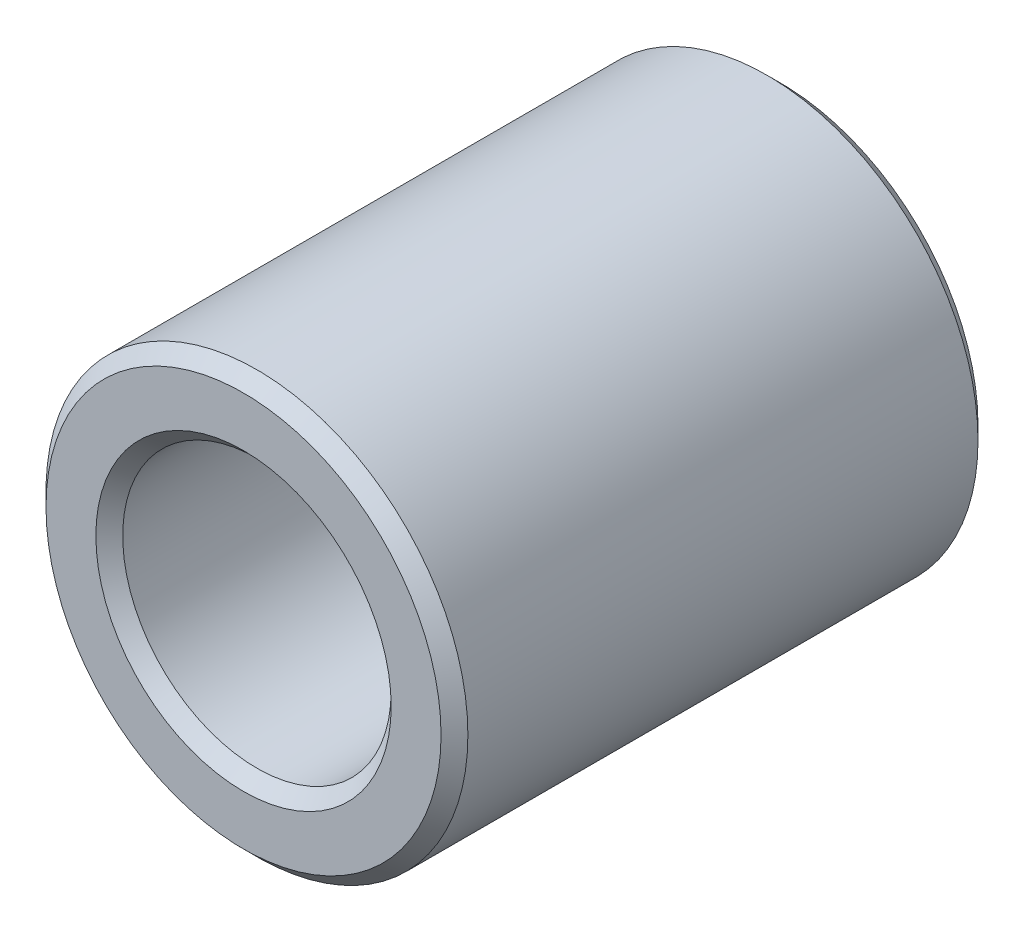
from build123d import *

# Parameters (mm, degrees)
SKETCH1_R           = 55
SKETCH1_R_2         = 35
BOSS_EXTRUDE1_DEPTH = 70
CHAMFER1_SIZE       = 3.5


with BuildPart() as part:
    # Sketch1 → Boss-Extrude1 (new, symmetric)
    with BuildSketch(Plane.XY):
        Circle(SKETCH1_R)
        Circle(SKETCH1_R_2, mode=Mode.SUBTRACT)
    extrude(amount=BOSS_EXTRUDE1_DEPTH, both=True)

    # Chamfer1
    chamfer1_edges = [part.edges().sort_by_distance(p)[0] for p in [
        (-55, 0, -70),
        (-55, 0, 70),
        (-35, 0, -70),
        (-35, 0, 70),
    ]]
    chamfer(chamfer1_edges, length=CHAMFER1_SIZE)


solid = part.part
